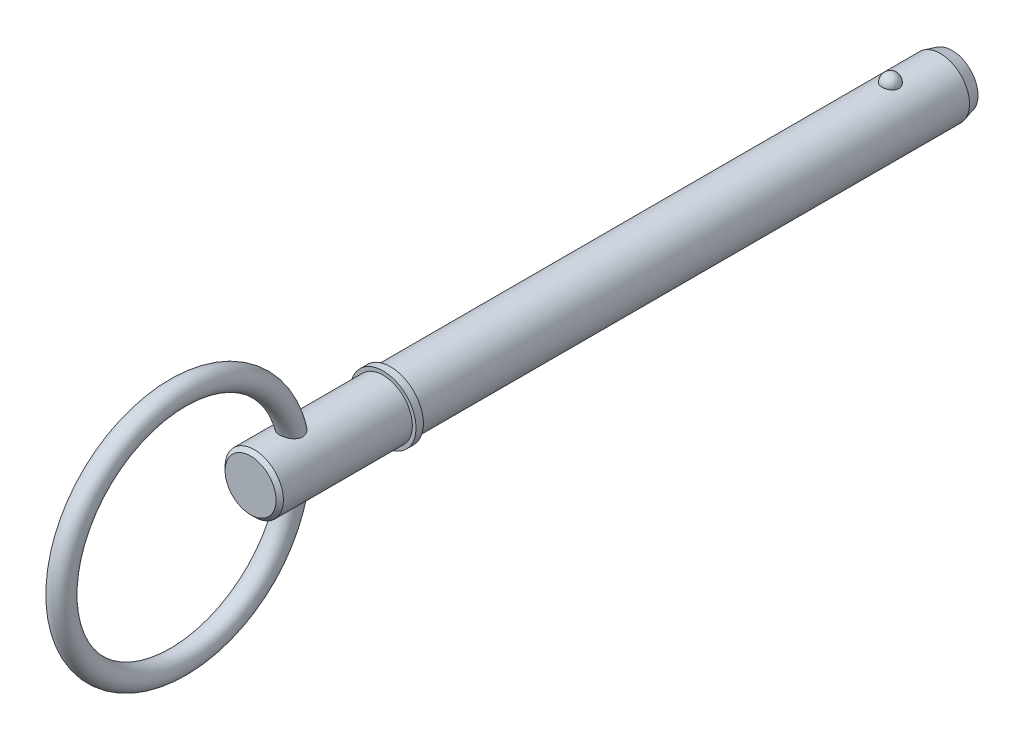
from build123d import *

# Parameters (mm, degrees)
SKETCH2_R           = 3.97
BOSS_EXTRUDE1_DEPTH = 66.9
BOSS_EXTRUDE2_START = 9.53
SKETCH3_R           = 3.97
BOSS_EXTRUDE2_DEPTH = 9.53
CHAMFER1_SIZE       = 1.586
CHAMFER1_SIZE2      = 0.424967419
SKETCH20_W          = 1
SKETCH20_H          = 4.47
SKETCH21_R          = 3.97
BOSS_EXTRUDE3_DEPTH = 19.05
CHAMFER2_SIZE       = 0.5
SKETCH24_R          = 1.5


with BuildPart() as part:
    # Sketch2 → Boss-Extrude1 (new body)
    with BuildSketch(Plane.XY):
        Circle(SKETCH2_R)
    extrude(amount=BOSS_EXTRUDE1_DEPTH)

    # Sketch3 → Boss-Extrude2 (add)
    with BuildSketch(Plane(origin=(0, 0, 0), x_dir=(-1, 0, 0), z_dir=(0, 0, -1)).offset(BOSS_EXTRUDE2_START)):
        Circle(SKETCH3_R)
    extrude(amount=-BOSS_EXTRUDE2_DEPTH)

    # Chamfer1
    chamfer1_edges = [part.edges().sort_by_distance(p)[0] for p in [
        (3.97, 0, -9.53),
    ]]
    chamfer1_side = [part.faces().sort_by_distance(p)[0] for p in [
        (3.97, 0, -4.765),
    ]]
    chamfer(chamfer1_edges, length=CHAMFER1_SIZE, length2=CHAMFER1_SIZE2, reference=chamfer1_side[0])

    # Sketch18 → Revolve1 (revolve)
    with BuildSketch(Plane(origin=(0, 0, 0), x_dir=(0, 0, -1), z_dir=(1, 0, 0))):
        with BuildLine():
            Line((1.15, 5.12), (1.15, 2.82))
            ThreePointArc((1.15, 2.82), (0, 3.97), (1.15, 5.12))
        make_face()
    revolve(axis=Axis((0, 5.12, -1.15), (0, -1, 0)))

    # Sketch20 → Revolve2 (revolve)
    with BuildSketch(Plane(origin=(0, 0, 0), x_dir=(0, 0, -1), z_dir=(1, 0, 0)), mode=Mode.PRIVATE) as revolve2_sk:
        with Locations((-67.4, 2.235)):
            Rectangle(SKETCH20_W, SKETCH20_H)
    revolve(revolve2_sk.sketch.rotate(Axis((0, 0, 33.728787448), (0, 0, 1)), 90), axis=Axis((0, 0, 33.728787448), (0, 0, 1)))

    # Sketch21 → Boss-Extrude3 (add)
    with BuildSketch(Plane(origin=(0, 0, 66.9), x_dir=(-1, 0, 0), z_dir=(0, 0, -1))):
        Circle(SKETCH21_R)
    extrude(amount=-BOSS_EXTRUDE3_DEPTH)

    # Chamfer2
    chamfer2_edges = [part.edges().sort_by_distance(p)[0] for p in [
        (3.97, 0, 85.95),
    ]]
    chamfer(chamfer2_edges, length=CHAMFER2_SIZE)

    # Sweep1: sweep along a path in Sketch23
    with BuildLine(Plane(origin=(0, 0, 0), x_dir=(0, 0, -1), z_dir=(1, 0, 0))) as sweep1_path:
        CenterArc((-95.825, 0), 15.875, 0, 360)
    # Sketch24 → Sweep1 (sweep)
    with BuildSketch(Plane(origin=(0, 0, 0), x_dir=(1, 0, 0), z_dir=(0, 1, 0))):
        with Locations((0, -79.95)):
            Circle(SKETCH24_R)
    sweep(path=sweep1_path.line)


solid = part.part
